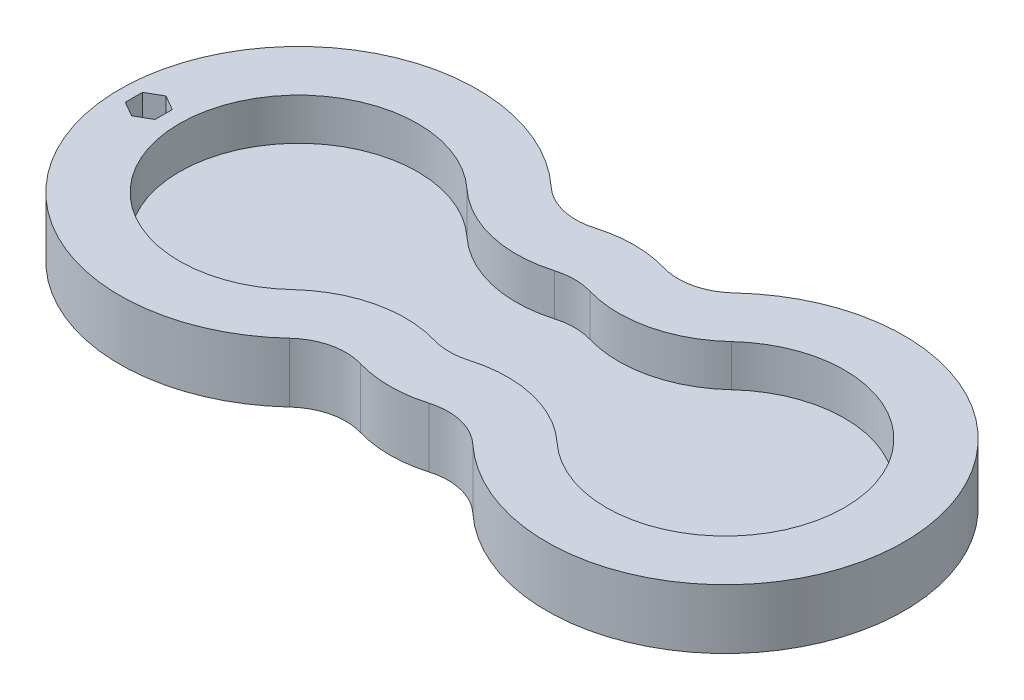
from build123d import *

# Parameters (mm, degrees)
EXTRUDE1_DEPTH     = 12.7
CUT_EXTRUDE1_DEPTH = 8.89
CUT_EXTRUDE2_DEPTH = 5.08


with BuildPart() as part:
    # Sketch1 → Extrude1 (new body)
    with BuildSketch(Plane(origin=(0, 0, 0), x_dir=(1, 0, 0), z_dir=(0, 1, 0))):
        with BuildLine():
            ThreePointArc((-7.323244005, -25.005246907), (0, -26.055561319), (7.323244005, -25.005246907))
            ThreePointArc((7.323244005, -25.005246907), (13.814065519, -24.833858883), (19.54127166, -27.893147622))
            ThreePointArc((19.54127166, -27.893147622), (83.570071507, 0), (19.54127166, 27.893147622))
            ThreePointArc((19.54127166, 27.893147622), (13.814065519, 24.833858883), (7.323244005, 25.005246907))
            ThreePointArc((7.323244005, 25.005246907), (0, 26.055561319), (-7.323244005, 25.005246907))
            ThreePointArc((-7.323244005, 25.005246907), (-13.814065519, 24.833858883), (-19.54127166, 27.893147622))
            ThreePointArc((-19.54127166, 27.893147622), (-83.570071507, 0), (-19.54127166, -27.893147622))
            ThreePointArc((-19.54127166, -27.893147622), (-13.814065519, -24.833858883), (-7.323244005, -25.005246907))
        make_face()
    extrude(amount=EXTRUDE1_DEPTH)

    # Sketch2 → Cut-Extrude1 (cut)
    with BuildSketch(Plane(origin=(0, 12.7, 0), x_dir=(1, 0, 0), z_dir=(0, 1, 0))):
        with BuildLine():
            ThreePointArc((-28.189804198, 18.59299252), (-16.735391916, 12.474415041), (-3.75374889, 12.817191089))
            ThreePointArc((-3.75374889, 12.817191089), (0, 13.355561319), (3.75374889, 12.817191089))
            ThreePointArc((3.75374889, 12.817191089), (16.735391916, 12.474415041), (28.189804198, 18.59299252))
            ThreePointArc((28.189804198, 18.59299252), (70.870071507, 0), (28.189804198, -18.59299252))
            ThreePointArc((28.189804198, -18.59299252), (16.735391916, -12.474415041), (3.75374889, -12.817191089))
            ThreePointArc((3.75374889, -12.817191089), (0, -13.355561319), (-3.75374889, -12.817191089))
            ThreePointArc((-3.75374889, -12.817191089), (-16.735391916, -12.474415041), (-28.189804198, -18.59299252))
            ThreePointArc((-28.189804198, -18.59299252), (-70.870071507, 0), (-28.189804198, 18.59299252))
        make_face()
    extrude(amount=-CUT_EXTRUDE1_DEPTH, mode=Mode.SUBTRACT)

    # Sketch3 → Cut-Extrude2 (cut)
    with BuildSketch(Plane(origin=(0, 12.7, 0), x_dir=(1, 0, 0), z_dir=(0, 1, 0))):
        Polygon((-77.396433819, 3.666174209), (-80.571433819, 1.833087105), (-80.571433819, -1.833087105), (-77.396433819, -3.666174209), (-74.221433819, -1.833087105), (-74.221433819, 1.833087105), align=None)
    extrude(amount=-CUT_EXTRUDE2_DEPTH, mode=Mode.SUBTRACT)


solid = part.part
